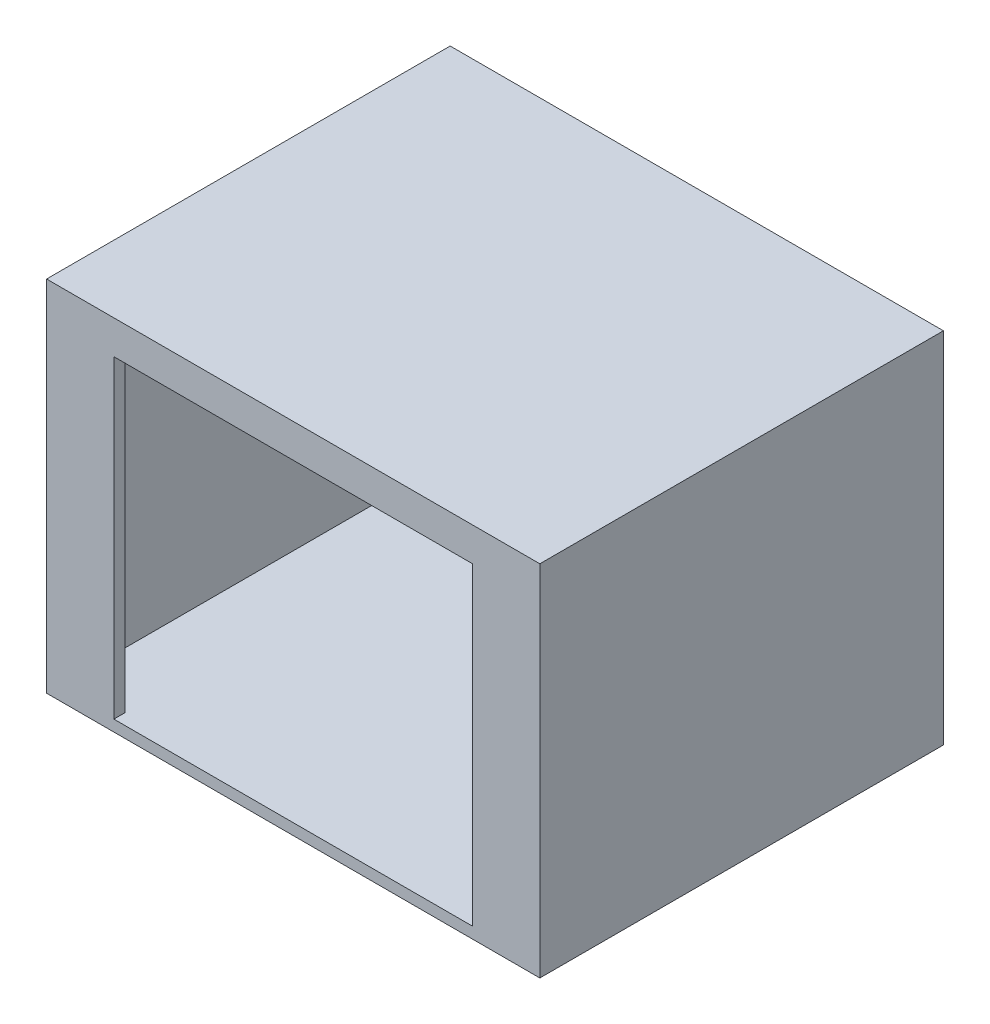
ISO-10303-21;
HEADER;
FILE_DESCRIPTION(('STEP AP214'),'2;1');
FILE_NAME('part.step','',(''),(''),'','','');
FILE_SCHEMA(('AUTOMOTIVE_DESIGN { 1 0 10303 214 1 1 1 1 }'));
ENDSEC;
DATA;
#1=APPLICATION_CONTEXT('core data for automotive mechanical design processes');
#2=APPLICATION_PROTOCOL_DEFINITION('international standard','automotive_design',2000,#1);
#3=PRODUCT_CONTEXT('',#1,'mechanical');
#4=PRODUCT('Part','Part','',(#3));
#5=PRODUCT_RELATED_PRODUCT_CATEGORY('part','',(#4));
#6=PRODUCT_DEFINITION_FORMATION('','',#4);
#7=PRODUCT_DEFINITION_CONTEXT('part definition',#1,'design');
#8=PRODUCT_DEFINITION('design','',#6,#7);
#9=PRODUCT_DEFINITION_SHAPE('','',#8);
#10=(LENGTH_UNIT() NAMED_UNIT(*) SI_UNIT(.MILLI.,.METRE.));
#11=(NAMED_UNIT(*) PLANE_ANGLE_UNIT() SI_UNIT($,.RADIAN.));
#12=(NAMED_UNIT(*) SI_UNIT($,.STERADIAN.) SOLID_ANGLE_UNIT());
#13=UNCERTAINTY_MEASURE_WITH_UNIT(LENGTH_MEASURE(1.E-05),#10,'distance_accuracy_value','');
#14=(GEOMETRIC_REPRESENTATION_CONTEXT(3) GLOBAL_UNCERTAINTY_ASSIGNED_CONTEXT((#13)) GLOBAL_UNIT_ASSIGNED_CONTEXT((#10,
#11,#12)) REPRESENTATION_CONTEXT('',''));
#15=CARTESIAN_POINT('',(0.,0.,0.));
#16=DIRECTION('',(0.,0.,1.));
#17=DIRECTION('',(1.,0.,0.));
#18=AXIS2_PLACEMENT_3D('',#15,#16,#17);
#19=CARTESIAN_POINT('',(-279.4,406.4,-12.7));
#20=DIRECTION('',(0.,0.,-1.));
#21=DIRECTION('',(-1.,0.,0.));
#22=AXIS2_PLACEMENT_3D('',#19,#20,#21);
#23=PLANE('',#22);
#24=DIRECTION('',(-1.,0.,0.));
#25=VECTOR('',#24,1.);
#26=CARTESIAN_POINT('',(-203.2,368.3,-12.7));
#27=LINE('',#26,#25);
#28=CARTESIAN_POINT('',(203.2,368.3,-12.7));
#29=VERTEX_POINT('',#28);
#30=CARTESIAN_POINT('',(-203.2,368.3,-12.7));
#31=VERTEX_POINT('',#30);
#32=EDGE_CURVE('E190',#29,#31,#27,.T.);
#33=ORIENTED_EDGE('',*,*,#32,.T.);
#34=DIRECTION('',(0.,-1.,0.));
#35=VECTOR('',#34,1.);
#36=CARTESIAN_POINT('',(-203.2,12.7,-12.7));
#37=LINE('',#36,#35);
#38=CARTESIAN_POINT('',(-203.2,12.7,-12.7));
#39=VERTEX_POINT('',#38);
#40=EDGE_CURVE('E188',#31,#39,#37,.T.);
#41=ORIENTED_EDGE('',*,*,#40,.T.);
#42=DIRECTION('',(1.,0.,0.));
#43=VECTOR('',#42,1.);
#44=CARTESIAN_POINT('',(-279.4,12.7,-12.7));
#45=LINE('',#44,#43);
#46=CARTESIAN_POINT('',(-266.7,12.7,-12.7));
#47=VERTEX_POINT('',#46);
#48=EDGE_CURVE('E140',#47,#39,#45,.T.);
#49=ORIENTED_EDGE('',*,*,#48,.F.);
#50=DIRECTION('',(0.,-1.,0.));
#51=VECTOR('',#50,1.);
#52=CARTESIAN_POINT('',(-266.7,406.4,-12.7));
#53=LINE('',#52,#51);
#54=CARTESIAN_POINT('',(-266.7,393.7,-12.7));
#55=VERTEX_POINT('',#54);
#56=EDGE_CURVE('E144',#55,#47,#53,.T.);
#57=ORIENTED_EDGE('',*,*,#56,.F.);
#58=DIRECTION('',(1.,0.,0.));
#59=VECTOR('',#58,1.);
#60=CARTESIAN_POINT('',(-279.4,393.7,-12.7));
#61=LINE('',#60,#59);
#62=CARTESIAN_POINT('',(266.7,393.7,-12.7));
#63=VERTEX_POINT('',#62);
#64=EDGE_CURVE('E170',#55,#63,#61,.T.);
#65=ORIENTED_EDGE('',*,*,#64,.T.);
#66=DIRECTION('',(0.,-1.,0.));
#67=VECTOR('',#66,1.);
#68=CARTESIAN_POINT('',(266.7,406.4,-12.7));
#69=LINE('',#68,#67);
#70=CARTESIAN_POINT('',(266.7,12.7,-12.7));
#71=VERTEX_POINT('',#70);
#72=EDGE_CURVE('E138',#63,#71,#69,.T.);
#73=ORIENTED_EDGE('',*,*,#72,.T.);
#74=CARTESIAN_POINT('',(203.2,12.7,-12.7000000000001));
#75=VERTEX_POINT('',#74);
#76=EDGE_CURVE('E131',#75,#71,#45,.T.);
#77=ORIENTED_EDGE('',*,*,#76,.F.);
#78=DIRECTION('',(0.,1.,0.));
#79=VECTOR('',#78,1.);
#80=CARTESIAN_POINT('',(203.2,12.7,-12.7));
#81=LINE('',#80,#79);
#82=EDGE_CURVE('E119',#75,#29,#81,.T.);
#83=ORIENTED_EDGE('',*,*,#82,.T.);
#84=EDGE_LOOP('',(#33,#41,#49,#57,#65,#73,#77,#83));
#85=FACE_BOUND('',#84,.T.);
#86=ADVANCED_FACE('F31',(#85),#23,.T.);
#87=CARTESIAN_POINT('',(-266.7,406.4,0.));
#88=DIRECTION('',(1.,0.,0.));
#89=DIRECTION('',(0.,0.,-1.));
#90=AXIS2_PLACEMENT_3D('',#87,#88,#89);
#91=PLANE('',#90);
#92=DIRECTION('',(0.,0.,1.));
#93=VECTOR('',#92,1.);
#94=CARTESIAN_POINT('',(-266.7,12.7,-457.2));
#95=LINE('',#94,#93);
#96=CARTESIAN_POINT('',(-266.7,12.7,-444.5));
#97=VERTEX_POINT('',#96);
#98=EDGE_CURVE('E147',#97,#47,#95,.T.);
#99=ORIENTED_EDGE('',*,*,#98,.F.);
#100=DIRECTION('',(0.,-1.,0.));
#101=VECTOR('',#100,1.);
#102=CARTESIAN_POINT('',(-266.7,406.4,-444.5));
#103=LINE('',#102,#101);
#104=CARTESIAN_POINT('',(-266.7,393.7,-444.5));
#105=VERTEX_POINT('',#104);
#106=EDGE_CURVE('E141',#105,#97,#103,.T.);
#107=ORIENTED_EDGE('',*,*,#106,.F.);
#108=DIRECTION('',(0.,0.,1.));
#109=VECTOR('',#108,1.);
#110=CARTESIAN_POINT('',(-266.7,393.7,-457.2));
#111=LINE('',#110,#109);
#112=EDGE_CURVE('E172',#105,#55,#111,.T.);
#113=ORIENTED_EDGE('',*,*,#112,.T.);
#114=ORIENTED_EDGE('',*,*,#56,.T.);
#115=EDGE_LOOP('',(#99,#107,#113,#114));
#116=FACE_BOUND('',#115,.T.);
#117=ADVANCED_FACE('F184',(#116),#91,.T.);
#118=CARTESIAN_POINT('',(266.7,406.4,0.));
#119=DIRECTION('',(-1.,0.,0.));
#120=DIRECTION('',(0.,0.,1.));
#121=AXIS2_PLACEMENT_3D('',#118,#119,#120);
#122=PLANE('',#121);
#123=DIRECTION('',(0.,0.,-1.));
#124=VECTOR('',#123,1.);
#125=CARTESIAN_POINT('',(266.7,12.7,-457.2));
#126=LINE('',#125,#124);
#127=CARTESIAN_POINT('',(266.7,12.7,-444.5));
#128=VERTEX_POINT('',#127);
#129=EDGE_CURVE('E180',#71,#128,#126,.T.);
#130=ORIENTED_EDGE('',*,*,#129,.F.);
#131=ORIENTED_EDGE('',*,*,#72,.F.);
#132=DIRECTION('',(0.,0.,-1.));
#133=VECTOR('',#132,1.);
#134=CARTESIAN_POINT('',(266.7,393.7,-457.2));
#135=LINE('',#134,#133);
#136=CARTESIAN_POINT('',(266.7,393.7,-444.5));
#137=VERTEX_POINT('',#136);
#138=EDGE_CURVE('E40',#63,#137,#135,.T.);
#139=ORIENTED_EDGE('',*,*,#138,.T.);
#140=DIRECTION('',(0.,-1.,0.));
#141=VECTOR('',#140,1.);
#142=CARTESIAN_POINT('',(266.7,406.4,-444.5));
#143=LINE('',#142,#141);
#144=EDGE_CURVE('E175',#137,#128,#143,.T.);
#145=ORIENTED_EDGE('',*,*,#144,.T.);
#146=EDGE_LOOP('',(#130,#131,#139,#145));
#147=FACE_BOUND('',#146,.T.);
#148=ADVANCED_FACE('F262',(#147),#122,.T.);
#149=CARTESIAN_POINT('',(-279.4,406.4,-444.5));
#150=DIRECTION('',(0.,0.,1.));
#151=DIRECTION('',(1.,0.,0.));
#152=AXIS2_PLACEMENT_3D('',#149,#150,#151);
#153=PLANE('',#152);
#154=DIRECTION('',(-1.,0.,0.));
#155=VECTOR('',#154,1.);
#156=CARTESIAN_POINT('',(-279.4,12.7,-444.5));
#157=LINE('',#156,#155);
#158=EDGE_CURVE('E178',#128,#97,#157,.T.);
#159=ORIENTED_EDGE('',*,*,#158,.F.);
#160=ORIENTED_EDGE('',*,*,#144,.F.);
#161=DIRECTION('',(-1.,0.,0.));
#162=VECTOR('',#161,1.);
#163=CARTESIAN_POINT('',(-279.4,393.7,-444.5));
#164=LINE('',#163,#162);
#165=EDGE_CURVE('E11',#137,#105,#164,.T.);
#166=ORIENTED_EDGE('',*,*,#165,.T.);
#167=ORIENTED_EDGE('',*,*,#106,.T.);
#168=EDGE_LOOP('',(#159,#160,#166,#167));
#169=FACE_BOUND('',#168,.T.);
#170=ADVANCED_FACE('F267',(#169),#153,.T.);
#171=CARTESIAN_POINT('',(-279.4,393.7,-457.2));
#172=DIRECTION('',(0.,-1.,0.));
#173=DIRECTION('',(0.,0.,-1.));
#174=AXIS2_PLACEMENT_3D('',#171,#172,#173);
#175=PLANE('',#174);
#176=ORIENTED_EDGE('',*,*,#112,.F.);
#177=ORIENTED_EDGE('',*,*,#165,.F.);
#178=ORIENTED_EDGE('',*,*,#138,.F.);
#179=ORIENTED_EDGE('',*,*,#64,.F.);
#180=EDGE_LOOP('',(#176,#177,#178,#179));
#181=FACE_BOUND('',#180,.T.);
#182=ADVANCED_FACE('F270',(#181),#175,.T.);
#183=CARTESIAN_POINT('',(-279.4,12.7,-457.2));
#184=DIRECTION('',(0.,-1.,0.));
#185=DIRECTION('',(0.,0.,-1.));
#186=AXIS2_PLACEMENT_3D('',#183,#184,#185);
#187=PLANE('',#186);
#188=ORIENTED_EDGE('',*,*,#98,.T.);
#189=ORIENTED_EDGE('',*,*,#48,.T.);
#190=DIRECTION('',(0.,0.,1.));
#191=VECTOR('',#190,1.);
#192=CARTESIAN_POINT('',(-203.2,12.7,-457.201));
#193=LINE('',#192,#191);
#194=CARTESIAN_POINT('',(-203.2,12.7,0.));
#195=VERTEX_POINT('',#194);
#196=EDGE_CURVE('E189',#39,#195,#193,.T.);
#197=ORIENTED_EDGE('',*,*,#196,.T.);
#198=DIRECTION('',(1.,0.,0.));
#199=VECTOR('',#198,1.);
#200=CARTESIAN_POINT('',(-203.2,12.7,0.));
#201=LINE('',#200,#199);
#202=CARTESIAN_POINT('',(203.2,12.7,0.));
#203=VERTEX_POINT('',#202);
#204=EDGE_CURVE('E134',#195,#203,#201,.T.);
#205=ORIENTED_EDGE('',*,*,#204,.T.);
#206=DIRECTION('',(0.,0.,1.));
#207=VECTOR('',#206,1.);
#208=CARTESIAN_POINT('',(203.2,12.7,-457.201));
#209=LINE('',#208,#207);
#210=EDGE_CURVE('E122',#75,#203,#209,.T.);
#211=ORIENTED_EDGE('',*,*,#210,.F.);
#212=ORIENTED_EDGE('',*,*,#76,.T.);
#213=ORIENTED_EDGE('',*,*,#129,.T.);
#214=ORIENTED_EDGE('',*,*,#158,.T.);
#215=EDGE_LOOP('',(#188,#189,#197,#205,#211,#212,#213,#214));
#216=FACE_BOUND('',#215,.T.);
#217=ADVANCED_FACE('F33',(#216),#187,.F.);
#218=CARTESIAN_POINT('',(-203.2,12.7,-457.201));
#219=DIRECTION('',(-1.,0.,0.));
#220=DIRECTION('',(0.,0.,1.));
#221=AXIS2_PLACEMENT_3D('',#218,#219,#220);
#222=PLANE('',#221);
#223=DIRECTION('',(0.,0.,1.));
#224=VECTOR('',#223,1.);
#225=CARTESIAN_POINT('',(-203.2,368.3,-457.201));
#226=LINE('',#225,#224);
#227=CARTESIAN_POINT('',(-203.2,368.3,0.));
#228=VERTEX_POINT('',#227);
#229=EDGE_CURVE('E127',#31,#228,#226,.T.);
#230=ORIENTED_EDGE('',*,*,#229,.T.);
#231=DIRECTION('',(0.,-1.,0.));
#232=VECTOR('',#231,1.);
#233=CARTESIAN_POINT('',(-203.2,12.7,0.));
#234=LINE('',#233,#232);
#235=EDGE_CURVE('E56',#228,#195,#234,.T.);
#236=ORIENTED_EDGE('',*,*,#235,.T.);
#237=ORIENTED_EDGE('',*,*,#196,.F.);
#238=ORIENTED_EDGE('',*,*,#40,.F.);
#239=EDGE_LOOP('',(#230,#236,#237,#238));
#240=FACE_BOUND('',#239,.T.);
#241=ADVANCED_FACE('F277',(#240),#222,.F.);
#242=CARTESIAN_POINT('',(-203.2,368.3,-457.201));
#243=DIRECTION('',(0.,1.,0.));
#244=DIRECTION('',(0.,0.,1.));
#245=AXIS2_PLACEMENT_3D('',#242,#243,#244);
#246=PLANE('',#245);
#247=DIRECTION('',(0.,0.,1.));
#248=VECTOR('',#247,1.);
#249=CARTESIAN_POINT('',(203.2,368.3,-457.201));
#250=LINE('',#249,#248);
#251=CARTESIAN_POINT('',(203.2,368.3,0.));
#252=VERTEX_POINT('',#251);
#253=EDGE_CURVE('E48',#29,#252,#250,.T.);
#254=ORIENTED_EDGE('',*,*,#253,.T.);
#255=DIRECTION('',(-1.,0.,0.));
#256=VECTOR('',#255,1.);
#257=CARTESIAN_POINT('',(-203.2,368.3,0.));
#258=LINE('',#257,#256);
#259=EDGE_CURVE('E196',#252,#228,#258,.T.);
#260=ORIENTED_EDGE('',*,*,#259,.T.);
#261=ORIENTED_EDGE('',*,*,#229,.F.);
#262=ORIENTED_EDGE('',*,*,#32,.F.);
#263=EDGE_LOOP('',(#254,#260,#261,#262));
#264=FACE_BOUND('',#263,.T.);
#265=ADVANCED_FACE('F285',(#264),#246,.F.);
#266=CARTESIAN_POINT('',(203.2,12.7,-457.201));
#267=DIRECTION('',(1.,0.,0.));
#268=DIRECTION('',(0.,1.,0.));
#269=AXIS2_PLACEMENT_3D('',#266,#267,#268);
#270=PLANE('',#269);
#271=ORIENTED_EDGE('',*,*,#210,.T.);
#272=DIRECTION('',(0.,1.,0.));
#273=VECTOR('',#272,1.);
#274=CARTESIAN_POINT('',(203.2,12.7,0.));
#275=LINE('',#274,#273);
#276=EDGE_CURVE('E194',#203,#252,#275,.T.);
#277=ORIENTED_EDGE('',*,*,#276,.T.);
#278=ORIENTED_EDGE('',*,*,#253,.F.);
#279=ORIENTED_EDGE('',*,*,#82,.F.);
#280=EDGE_LOOP('',(#271,#277,#278,#279));
#281=FACE_BOUND('',#280,.T.);
#282=ADVANCED_FACE('F121',(#281),#270,.F.);
#283=CARTESIAN_POINT('',(-279.4,406.4,0.));
#284=DIRECTION('',(1.,0.,0.));
#285=DIRECTION('',(0.,0.,-1.));
#286=AXIS2_PLACEMENT_3D('',#283,#284,#285);
#287=PLANE('',#286);
#288=DIRECTION('',(0.,0.,1.));
#289=VECTOR('',#288,1.);
#290=CARTESIAN_POINT('',(-279.4,0.,0.));
#291=LINE('',#290,#289);
#292=CARTESIAN_POINT('',(-279.4,0.,-457.2));
#293=VERTEX_POINT('',#292);
#294=CARTESIAN_POINT('',(-279.4,0.,0.));
#295=VERTEX_POINT('',#294);
#296=EDGE_CURVE('E210',#293,#295,#291,.T.);
#297=ORIENTED_EDGE('',*,*,#296,.T.);
#298=DIRECTION('',(0.,-1.,0.));
#299=VECTOR('',#298,1.);
#300=CARTESIAN_POINT('',(-279.4,406.4,0.));
#301=LINE('',#300,#299);
#302=CARTESIAN_POINT('',(-279.4,406.4,0.));
#303=VERTEX_POINT('',#302);
#304=EDGE_CURVE('E156',#303,#295,#301,.T.);
#305=ORIENTED_EDGE('',*,*,#304,.F.);
#306=DIRECTION('',(0.,0.,1.));
#307=VECTOR('',#306,1.);
#308=CARTESIAN_POINT('',(-279.4,406.4,0.));
#309=LINE('',#308,#307);
#310=CARTESIAN_POINT('',(-279.4,406.4,-457.2));
#311=VERTEX_POINT('',#310);
#312=EDGE_CURVE('E218',#311,#303,#309,.T.);
#313=ORIENTED_EDGE('',*,*,#312,.F.);
#314=DIRECTION('',(0.,-1.,0.));
#315=VECTOR('',#314,1.);
#316=CARTESIAN_POINT('',(-279.4,406.4,-457.2));
#317=LINE('',#316,#315);
#318=EDGE_CURVE('E227',#311,#293,#317,.T.);
#319=ORIENTED_EDGE('',*,*,#318,.T.);
#320=EDGE_LOOP('',(#297,#305,#313,#319));
#321=FACE_BOUND('',#320,.T.);
#322=ADVANCED_FACE('F243',(#321),#287,.F.);
#323=CARTESIAN_POINT('',(-279.4,406.4,0.));
#324=DIRECTION('',(0.,0.,-1.));
#325=DIRECTION('',(-1.,0.,0.));
#326=AXIS2_PLACEMENT_3D('',#323,#324,#325);
#327=PLANE('',#326);
#328=ORIENTED_EDGE('',*,*,#204,.F.);
#329=ORIENTED_EDGE('',*,*,#235,.F.);
#330=ORIENTED_EDGE('',*,*,#259,.F.);
#331=ORIENTED_EDGE('',*,*,#276,.F.);
#332=EDGE_LOOP('',(#328,#329,#330,#331));
#333=FACE_BOUND('',#332,.T.);
#334=DIRECTION('',(1.,0.,0.));
#335=VECTOR('',#334,1.);
#336=CARTESIAN_POINT('',(-279.4,0.,0.));
#337=LINE('',#336,#335);
#338=CARTESIAN_POINT('',(279.4,0.,0.));
#339=VERTEX_POINT('',#338);
#340=EDGE_CURVE('E212',#295,#339,#337,.T.);
#341=ORIENTED_EDGE('',*,*,#340,.T.);
#342=DIRECTION('',(0.,-1.,0.));
#343=VECTOR('',#342,1.);
#344=CARTESIAN_POINT('',(279.4,406.4,0.));
#345=LINE('',#344,#343);
#346=CARTESIAN_POINT('',(279.4,406.4,0.));
#347=VERTEX_POINT('',#346);
#348=EDGE_CURVE('E159',#347,#339,#345,.T.);
#349=ORIENTED_EDGE('',*,*,#348,.F.);
#350=DIRECTION('',(1.,0.,0.));
#351=VECTOR('',#350,1.);
#352=CARTESIAN_POINT('',(-279.4,406.4,0.));
#353=LINE('',#352,#351);
#354=EDGE_CURVE('E221',#303,#347,#353,.T.);
#355=ORIENTED_EDGE('',*,*,#354,.F.);
#356=ORIENTED_EDGE('',*,*,#304,.T.);
#357=EDGE_LOOP('',(#341,#349,#355,#356));
#358=FACE_BOUND('',#357,.T.);
#359=ADVANCED_FACE('F192',(#333,#358),#327,.F.);
#360=CARTESIAN_POINT('',(279.4,406.4,0.));
#361=DIRECTION('',(-1.,0.,0.));
#362=DIRECTION('',(0.,0.,1.));
#363=AXIS2_PLACEMENT_3D('',#360,#361,#362);
#364=PLANE('',#363);
#365=DIRECTION('',(0.,0.,-1.));
#366=VECTOR('',#365,1.);
#367=CARTESIAN_POINT('',(279.4,0.,0.));
#368=LINE('',#367,#366);
#369=CARTESIAN_POINT('',(279.4,0.,-457.2));
#370=VERTEX_POINT('',#369);
#371=EDGE_CURVE('E214',#339,#370,#368,.T.);
#372=ORIENTED_EDGE('',*,*,#371,.T.);
#373=DIRECTION('',(0.,-1.,0.));
#374=VECTOR('',#373,1.);
#375=CARTESIAN_POINT('',(279.4,406.4,-457.2));
#376=LINE('',#375,#374);
#377=CARTESIAN_POINT('',(279.4,406.4,-457.2));
#378=VERTEX_POINT('',#377);
#379=EDGE_CURVE('E165',#378,#370,#376,.T.);
#380=ORIENTED_EDGE('',*,*,#379,.F.);
#381=DIRECTION('',(0.,0.,-1.));
#382=VECTOR('',#381,1.);
#383=CARTESIAN_POINT('',(279.4,406.4,0.));
#384=LINE('',#383,#382);
#385=EDGE_CURVE('E223',#347,#378,#384,.T.);
#386=ORIENTED_EDGE('',*,*,#385,.F.);
#387=ORIENTED_EDGE('',*,*,#348,.T.);
#388=EDGE_LOOP('',(#372,#380,#386,#387));
#389=FACE_BOUND('',#388,.T.);
#390=ADVANCED_FACE('F248',(#389),#364,.F.);
#391=CARTESIAN_POINT('',(-279.4,406.4,-457.2));
#392=DIRECTION('',(0.,0.,1.));
#393=DIRECTION('',(1.,0.,0.));
#394=AXIS2_PLACEMENT_3D('',#391,#392,#393);
#395=PLANE('',#394);
#396=DIRECTION('',(-1.,0.,0.));
#397=VECTOR('',#396,1.);
#398=CARTESIAN_POINT('',(-279.4,0.,-457.2));
#399=LINE('',#398,#397);
#400=EDGE_CURVE('E216',#370,#293,#399,.T.);
#401=ORIENTED_EDGE('',*,*,#400,.T.);
#402=ORIENTED_EDGE('',*,*,#318,.F.);
#403=DIRECTION('',(-1.,0.,0.));
#404=VECTOR('',#403,1.);
#405=CARTESIAN_POINT('',(-279.4,406.4,-457.2));
#406=LINE('',#405,#404);
#407=EDGE_CURVE('E225',#378,#311,#406,.T.);
#408=ORIENTED_EDGE('',*,*,#407,.F.);
#409=ORIENTED_EDGE('',*,*,#379,.T.);
#410=EDGE_LOOP('',(#401,#402,#408,#409));
#411=FACE_BOUND('',#410,.T.);
#412=ADVANCED_FACE('F234',(#411),#395,.F.);
#413=CARTESIAN_POINT('',(-279.4,406.4,-457.2));
#414=DIRECTION('',(0.,-1.,0.));
#415=DIRECTION('',(0.,0.,-1.));
#416=AXIS2_PLACEMENT_3D('',#413,#414,#415);
#417=PLANE('',#416);
#418=ORIENTED_EDGE('',*,*,#312,.T.);
#419=ORIENTED_EDGE('',*,*,#354,.T.);
#420=ORIENTED_EDGE('',*,*,#385,.T.);
#421=ORIENTED_EDGE('',*,*,#407,.T.);
#422=EDGE_LOOP('',(#418,#419,#420,#421));
#423=FACE_BOUND('',#422,.T.);
#424=ADVANCED_FACE('F246',(#423),#417,.F.);
#425=CARTESIAN_POINT('',(-279.4,0.,-457.2));
#426=DIRECTION('',(0.,-1.,0.));
#427=DIRECTION('',(0.,0.,-1.));
#428=AXIS2_PLACEMENT_3D('',#425,#426,#427);
#429=PLANE('',#428);
#430=ORIENTED_EDGE('',*,*,#296,.F.);
#431=ORIENTED_EDGE('',*,*,#400,.F.);
#432=ORIENTED_EDGE('',*,*,#371,.F.);
#433=ORIENTED_EDGE('',*,*,#340,.F.);
#434=EDGE_LOOP('',(#430,#431,#432,#433));
#435=FACE_BOUND('',#434,.T.);
#436=ADVANCED_FACE('F241',(#435),#429,.T.);
#437=CLOSED_SHELL('',(#86,#117,#148,#170,#182,#217,#241,#265,#282,#322,#359,#390,#412,#424,#436));
#438=MANIFOLD_SOLID_BREP('B2',#437);
#439=ADVANCED_BREP_SHAPE_REPRESENTATION('',(#18,#438),#14);
#440=SHAPE_DEFINITION_REPRESENTATION(#9,#439);
ENDSEC;
END-ISO-10303-21;
